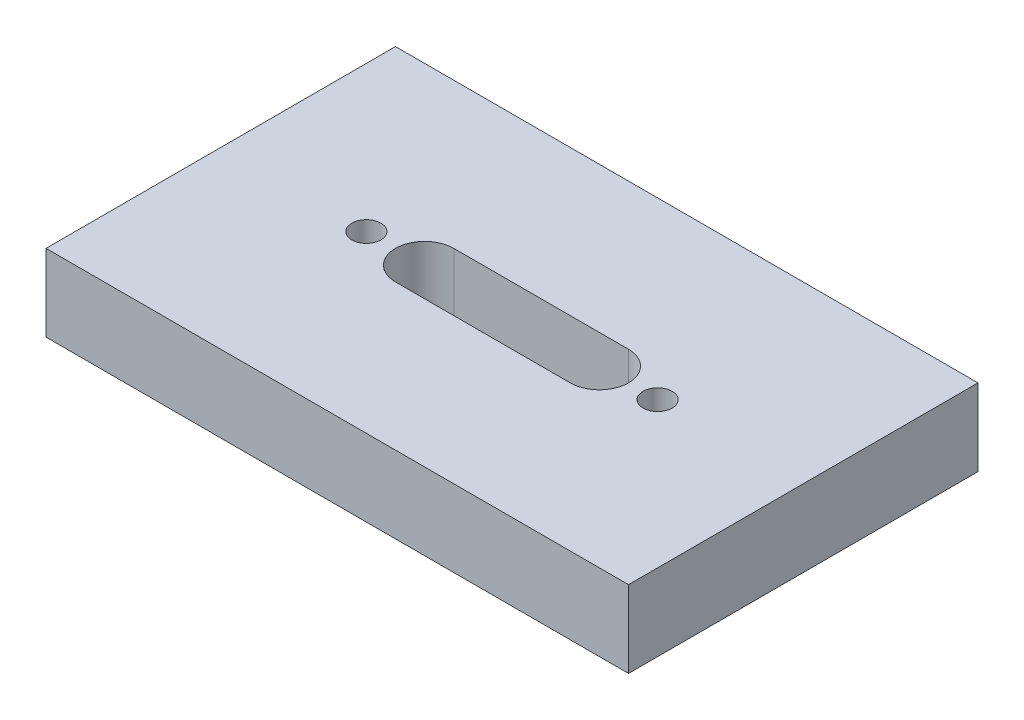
from build123d import *

# Parameters (mm, degrees)
SKETCH1_W           = 127
SKETCH1_H           = 76.2
BOSS_EXTRUDE1_DEPTH = 16.764
SKETCH2_R           = 3.175
CUT_EXTRUDE1_DEPTH  = 76.926883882


with BuildPart() as part:
    # Sketch1 → Boss-Extrude1 (new body)
    with BuildSketch(Plane(origin=(0, 0, 0), x_dir=(1, 0, 0), z_dir=(0, 1, 0))):
        Rectangle(SKETCH1_W, SKETCH1_H)
    extrude(amount=BOSS_EXTRUDE1_DEPTH)

    # Sketch2 → Cut-Extrude1 (cut, through all)
    with BuildSketch(Plane(origin=(0, 16.764, 0), x_dir=(1, 0, 0), z_dir=(0, 1, 0))):
        with Locations(Location((31.75, 0, 0), (0, 0, 270))):
            Circle(SKETCH2_R)
        with Locations(Location((-31.75, 0, 0), (0, 0, 90))):
            Circle(SKETCH2_R)
        with BuildLine():
            Line((-19.05, 6.35), (19.05, 6.35))
            ThreePointArc((19.05, 6.35), (25.4, 0), (19.05, -6.35))
            Line((19.05, -6.35), (-19.05, -6.35))
            ThreePointArc((-19.05, -6.35), (-25.4, 0), (-19.05, 6.35))
        make_face()
    extrude(amount=-CUT_EXTRUDE1_DEPTH, mode=Mode.SUBTRACT)


solid = part.part
